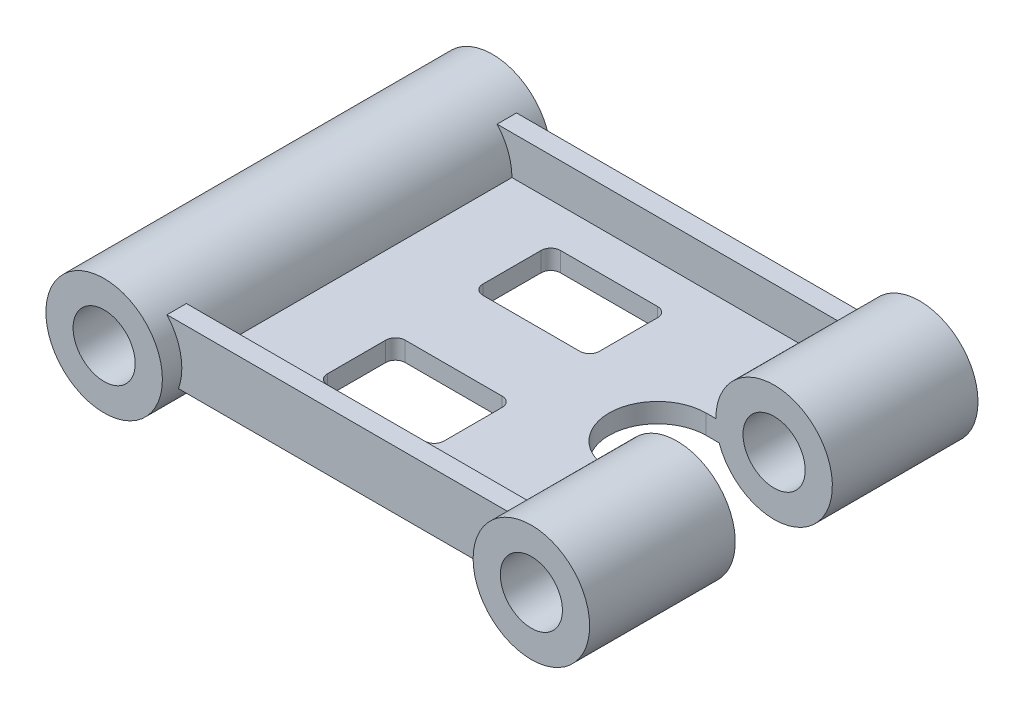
ISO-10303-21;
HEADER;
FILE_DESCRIPTION(('STEP AP214'),'2;1');
FILE_NAME('part.step','',(''),(''),'','','');
FILE_SCHEMA(('AUTOMOTIVE_DESIGN { 1 0 10303 214 1 1 1 1 }'));
ENDSEC;
DATA;
#1=APPLICATION_CONTEXT('core data for automotive mechanical design processes');
#2=APPLICATION_PROTOCOL_DEFINITION('international standard','automotive_design',2000,#1);
#3=PRODUCT_CONTEXT('',#1,'mechanical');
#4=PRODUCT('Part','Part','',(#3));
#5=PRODUCT_RELATED_PRODUCT_CATEGORY('part','',(#4));
#6=PRODUCT_DEFINITION_FORMATION('','',#4);
#7=PRODUCT_DEFINITION_CONTEXT('part definition',#1,'design');
#8=PRODUCT_DEFINITION('design','',#6,#7);
#9=PRODUCT_DEFINITION_SHAPE('','',#8);
#10=(LENGTH_UNIT() NAMED_UNIT(*) SI_UNIT(.MILLI.,.METRE.));
#11=(NAMED_UNIT(*) PLANE_ANGLE_UNIT() SI_UNIT($,.RADIAN.));
#12=(NAMED_UNIT(*) SI_UNIT($,.STERADIAN.) SOLID_ANGLE_UNIT());
#13=UNCERTAINTY_MEASURE_WITH_UNIT(LENGTH_MEASURE(1.E-05),#10,'distance_accuracy_value','');
#14=(GEOMETRIC_REPRESENTATION_CONTEXT(3) GLOBAL_UNCERTAINTY_ASSIGNED_CONTEXT((#13)) GLOBAL_UNIT_ASSIGNED_CONTEXT((#10,
#11,#12)) REPRESENTATION_CONTEXT('',''));
#15=CARTESIAN_POINT('',(0.,0.,0.));
#16=DIRECTION('',(0.,0.,1.));
#17=DIRECTION('',(1.,0.,0.));
#18=AXIS2_PLACEMENT_3D('',#15,#16,#17);
#19=CARTESIAN_POINT('',(220.,0.,100.));
#20=DIRECTION('',(0.,0.,-1.));
#21=DIRECTION('',(-1.,0.,0.));
#22=AXIS2_PLACEMENT_3D('',#19,#20,#21);
#23=CYLINDRICAL_SURFACE('',#22,30.);
#24=CARTESIAN_POINT('',(220.,0.,-100.));
#25=DIRECTION('',(0.,0.,1.));
#26=DIRECTION('',(1.,0.,0.));
#27=AXIS2_PLACEMENT_3D('',#24,#25,#26);
#28=CIRCLE('',#27,30.);
#29=CARTESIAN_POINT('',(250.,0.,-100.));
#30=VERTEX_POINT('',#29);
#31=EDGE_CURVE('E310',#30,#30,#28,.T.);
#32=ORIENTED_EDGE('',*,*,#31,.T.);
#33=EDGE_LOOP('',(#32));
#34=FACE_BOUND('',#33,.T.);
#35=CARTESIAN_POINT('',(220.,0.,-25.));
#36=DIRECTION('',(0.,0.,-1.));
#37=DIRECTION('',(-1.,0.,0.));
#38=AXIS2_PLACEMENT_3D('',#35,#36,#37);
#39=CIRCLE('',#38,30.);
#40=CARTESIAN_POINT('',(190.,0.,-25.));
#41=VERTEX_POINT('',#40);
#42=CARTESIAN_POINT('',(191.715728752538,-10.,-25.));
#43=VERTEX_POINT('',#42);
#44=EDGE_CURVE('E230',#41,#43,#39,.T.);
#45=ORIENTED_EDGE('',*,*,#44,.T.);
#46=DIRECTION('',(0.,0.,-1.));
#47=VECTOR('',#46,1.);
#48=CARTESIAN_POINT('',(191.715728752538,-9.99999999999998,90.));
#49=LINE('',#48,#47);
#50=CARTESIAN_POINT('',(191.715728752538,-9.99999999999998,-90.));
#51=VERTEX_POINT('',#50);
#52=EDGE_CURVE('E336',#43,#51,#49,.T.);
#53=ORIENTED_EDGE('',*,*,#52,.T.);
#54=CARTESIAN_POINT('',(220.,0.,-90.));
#55=DIRECTION('',(0.,0.,-1.));
#56=DIRECTION('',(1.,0.,0.));
#57=AXIS2_PLACEMENT_3D('',#54,#55,#56);
#58=CIRCLE('',#57,30.);
#59=CARTESIAN_POINT('',(197.639320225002,20.,-90.));
#60=VERTEX_POINT('',#59);
#61=EDGE_CURVE('E321',#51,#60,#58,.T.);
#62=ORIENTED_EDGE('',*,*,#61,.T.);
#63=DIRECTION('',(0.,0.,-1.));
#64=VECTOR('',#63,1.);
#65=CARTESIAN_POINT('',(197.639320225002,20.,-80.));
#66=LINE('',#65,#64);
#67=CARTESIAN_POINT('',(197.639320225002,20.,-80.));
#68=VERTEX_POINT('',#67);
#69=EDGE_CURVE('E272',#68,#60,#66,.T.);
#70=ORIENTED_EDGE('',*,*,#69,.F.);
#71=CARTESIAN_POINT('',(220.,0.,-80.));
#72=DIRECTION('',(0.,0.,-1.));
#73=DIRECTION('',(1.,0.,0.));
#74=AXIS2_PLACEMENT_3D('',#71,#72,#73);
#75=CIRCLE('',#74,30.);
#76=CARTESIAN_POINT('',(190.,0.,-79.9999999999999));
#77=VERTEX_POINT('',#76);
#78=EDGE_CURVE('E265',#77,#68,#75,.T.);
#79=ORIENTED_EDGE('',*,*,#78,.F.);
#80=DIRECTION('',(0.,0.,-1.));
#81=VECTOR('',#80,1.);
#82=CARTESIAN_POINT('',(190.,0.,90.));
#83=LINE('',#82,#81);
#84=EDGE_CURVE('E333',#41,#77,#83,.T.);
#85=ORIENTED_EDGE('',*,*,#84,.F.);
#86=EDGE_LOOP('',(#45,#53,#62,#70,#79,#85));
#87=FACE_BOUND('',#86,.T.);
#88=ADVANCED_FACE('F39',(#34,#87),#23,.T.);
#89=CARTESIAN_POINT('',(220.,0.,-100.));
#90=DIRECTION('',(0.,0.,1.));
#91=DIRECTION('',(1.,0.,0.));
#92=AXIS2_PLACEMENT_3D('',#89,#90,#91);
#93=CYLINDRICAL_SURFACE('',#92,16.);
#94=CARTESIAN_POINT('',(220.,0.,25.));
#95=DIRECTION('',(0.,0.,1.));
#96=DIRECTION('',(1.,0.,0.));
#97=AXIS2_PLACEMENT_3D('',#94,#95,#96);
#98=CIRCLE('',#97,16.);
#99=CARTESIAN_POINT('',(236.,0.,25.));
#100=VERTEX_POINT('',#99);
#101=EDGE_CURVE('E234',#100,#100,#98,.F.);
#102=ORIENTED_EDGE('',*,*,#101,.T.);
#103=EDGE_LOOP('',(#102));
#104=FACE_BOUND('',#103,.T.);
#105=CARTESIAN_POINT('',(220.,0.,100.));
#106=DIRECTION('',(0.,0.,1.));
#107=DIRECTION('',(1.,0.,0.));
#108=AXIS2_PLACEMENT_3D('',#105,#106,#107);
#109=CIRCLE('',#108,16.);
#110=CARTESIAN_POINT('',(236.,0.,100.));
#111=VERTEX_POINT('',#110);
#112=EDGE_CURVE('E296',#111,#111,#109,.T.);
#113=ORIENTED_EDGE('',*,*,#112,.T.);
#114=EDGE_LOOP('',(#113));
#115=FACE_BOUND('',#114,.T.);
#116=ADVANCED_FACE('F529',(#104,#115),#93,.F.);
#117=CARTESIAN_POINT('',(0.,0.,100.));
#118=DIRECTION('',(0.,0.,-1.));
#119=DIRECTION('',(-1.,0.,0.));
#120=AXIS2_PLACEMENT_3D('',#117,#118,#119);
#121=CYLINDRICAL_SURFACE('',#120,30.);
#122=CARTESIAN_POINT('',(0.,0.,100.));
#123=DIRECTION('',(0.,0.,1.));
#124=DIRECTION('',(1.,0.,0.));
#125=AXIS2_PLACEMENT_3D('',#122,#123,#124);
#126=CIRCLE('',#125,30.);
#127=CARTESIAN_POINT('',(30.,0.,100.));
#128=VERTEX_POINT('',#127);
#129=EDGE_CURVE('E346',#128,#128,#126,.T.);
#130=ORIENTED_EDGE('',*,*,#129,.F.);
#131=EDGE_LOOP('',(#130));
#132=FACE_BOUND('',#131,.T.);
#133=CARTESIAN_POINT('',(0.,0.,-100.));
#134=DIRECTION('',(0.,0.,1.));
#135=DIRECTION('',(1.,0.,0.));
#136=AXIS2_PLACEMENT_3D('',#133,#134,#135);
#137=CIRCLE('',#136,30.);
#138=CARTESIAN_POINT('',(30.,0.,-100.));
#139=VERTEX_POINT('',#138);
#140=EDGE_CURVE('E343',#139,#139,#137,.T.);
#141=ORIENTED_EDGE('',*,*,#140,.T.);
#142=EDGE_LOOP('',(#141));
#143=FACE_BOUND('',#142,.T.);
#144=CARTESIAN_POINT('',(0.,0.,-80.));
#145=DIRECTION('',(0.,0.,-1.));
#146=DIRECTION('',(1.,0.,0.));
#147=AXIS2_PLACEMENT_3D('',#144,#145,#146);
#148=CIRCLE('',#147,30.);
#149=CARTESIAN_POINT('',(22.3606797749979,20.,-80.));
#150=VERTEX_POINT('',#149);
#151=CARTESIAN_POINT('',(30.,0.,-79.9999999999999));
#152=VERTEX_POINT('',#151);
#153=EDGE_CURVE('E254',#150,#152,#148,.T.);
#154=ORIENTED_EDGE('',*,*,#153,.F.);
#155=DIRECTION('',(0.,0.,-1.));
#156=VECTOR('',#155,1.);
#157=CARTESIAN_POINT('',(22.3606797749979,20.,-80.));
#158=LINE('',#157,#156);
#159=CARTESIAN_POINT('',(22.3606797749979,20.,-90.));
#160=VERTEX_POINT('',#159);
#161=EDGE_CURVE('E271',#150,#160,#158,.T.);
#162=ORIENTED_EDGE('',*,*,#161,.T.);
#163=CARTESIAN_POINT('',(0.,0.,-90.));
#164=DIRECTION('',(0.,0.,-1.));
#165=DIRECTION('',(1.,0.,0.));
#166=AXIS2_PLACEMENT_3D('',#163,#164,#165);
#167=CIRCLE('',#166,30.);
#168=CARTESIAN_POINT('',(28.2842712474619,-10.,-90.));
#169=VERTEX_POINT('',#168);
#170=EDGE_CURVE('E316',#160,#169,#167,.T.);
#171=ORIENTED_EDGE('',*,*,#170,.T.);
#172=DIRECTION('',(0.,0.,-1.));
#173=VECTOR('',#172,1.);
#174=CARTESIAN_POINT('',(28.2842712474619,-10.,90.));
#175=LINE('',#174,#173);
#176=CARTESIAN_POINT('',(28.2842712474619,-9.99999999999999,90.));
#177=VERTEX_POINT('',#176);
#178=EDGE_CURVE('E340',#177,#169,#175,.T.);
#179=ORIENTED_EDGE('',*,*,#178,.F.);
#180=CARTESIAN_POINT('',(0.,0.,90.));
#181=DIRECTION('',(0.,0.,-1.));
#182=DIRECTION('',(1.,0.,0.));
#183=AXIS2_PLACEMENT_3D('',#180,#181,#182);
#184=CIRCLE('',#183,30.);
#185=CARTESIAN_POINT('',(22.3606797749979,20.,90.));
#186=VERTEX_POINT('',#185);
#187=EDGE_CURVE('E323',#186,#177,#184,.T.);
#188=ORIENTED_EDGE('',*,*,#187,.F.);
#189=DIRECTION('',(0.,0.,1.));
#190=VECTOR('',#189,1.);
#191=CARTESIAN_POINT('',(22.3606797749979,20.,80.));
#192=LINE('',#191,#190);
#193=CARTESIAN_POINT('',(22.3606797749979,20.,80.));
#194=VERTEX_POINT('',#193);
#195=EDGE_CURVE('E293',#194,#186,#192,.T.);
#196=ORIENTED_EDGE('',*,*,#195,.F.);
#197=CARTESIAN_POINT('',(0.,0.,80.));
#198=DIRECTION('',(0.,0.,-1.));
#199=DIRECTION('',(1.,0.,0.));
#200=AXIS2_PLACEMENT_3D('',#197,#198,#199);
#201=CIRCLE('',#200,30.);
#202=CARTESIAN_POINT('',(30.,0.,80.));
#203=VERTEX_POINT('',#202);
#204=EDGE_CURVE('E280',#194,#203,#201,.T.);
#205=ORIENTED_EDGE('',*,*,#204,.T.);
#206=DIRECTION('',(0.,0.,-1.));
#207=VECTOR('',#206,1.);
#208=CARTESIAN_POINT('',(30.,0.,90.));
#209=LINE('',#208,#207);
#210=EDGE_CURVE('E330',#203,#152,#209,.T.);
#211=ORIENTED_EDGE('',*,*,#210,.T.);
#212=EDGE_LOOP('',(#154,#162,#171,#179,#188,#196,#205,#211));
#213=FACE_BOUND('',#212,.T.);
#214=ADVANCED_FACE('F41',(#132,#143,#213),#121,.T.);
#215=CARTESIAN_POINT('',(30.,0.,90.));
#216=DIRECTION('',(0.,-1.,0.));
#217=DIRECTION('',(0.,0.,-1.));
#218=AXIS2_PLACEMENT_3D('',#215,#216,#217);
#219=PLANE('',#218);
#220=DIRECTION('',(-1.,0.,0.));
#221=VECTOR('',#220,1.);
#222=CARTESIAN_POINT('',(130.,0.,20.));
#223=LINE('',#222,#221);
#224=CARTESIAN_POINT('',(125.,0.,20.));
#225=VERTEX_POINT('',#224);
#226=CARTESIAN_POINT('',(75.,0.,20.));
#227=VERTEX_POINT('',#226);
#228=EDGE_CURVE('E790',#225,#227,#223,.T.);
#229=ORIENTED_EDGE('',*,*,#228,.F.);
#230=CARTESIAN_POINT('',(125.,0.,25.));
#231=DIRECTION('',(0.,-1.,0.));
#232=DIRECTION('',(0.,0.,-1.));
#233=AXIS2_PLACEMENT_3D('',#230,#231,#232);
#234=CIRCLE('',#233,5.);
#235=CARTESIAN_POINT('',(130.,0.,25.));
#236=VERTEX_POINT('',#235);
#237=EDGE_CURVE('E418',#225,#236,#234,.T.);
#238=ORIENTED_EDGE('',*,*,#237,.T.);
#239=DIRECTION('',(0.,0.,-1.));
#240=VECTOR('',#239,1.);
#241=CARTESIAN_POINT('',(130.,0.,20.));
#242=LINE('',#241,#240);
#243=CARTESIAN_POINT('',(130.,0.,55.));
#244=VERTEX_POINT('',#243);
#245=EDGE_CURVE('E786',#244,#236,#242,.T.);
#246=ORIENTED_EDGE('',*,*,#245,.F.);
#247=CARTESIAN_POINT('',(125.,0.,55.));
#248=DIRECTION('',(0.,-1.,0.));
#249=DIRECTION('',(0.,0.,-1.));
#250=AXIS2_PLACEMENT_3D('',#247,#248,#249);
#251=CIRCLE('',#250,5.);
#252=CARTESIAN_POINT('',(125.,0.,60.));
#253=VERTEX_POINT('',#252);
#254=EDGE_CURVE('E422',#244,#253,#251,.T.);
#255=ORIENTED_EDGE('',*,*,#254,.T.);
#256=DIRECTION('',(1.,0.,0.));
#257=VECTOR('',#256,1.);
#258=CARTESIAN_POINT('',(130.,0.,60.));
#259=LINE('',#258,#257);
#260=CARTESIAN_POINT('',(75.,0.,60.));
#261=VERTEX_POINT('',#260);
#262=EDGE_CURVE('E454',#261,#253,#259,.T.);
#263=ORIENTED_EDGE('',*,*,#262,.F.);
#264=CARTESIAN_POINT('',(75.,0.,55.));
#265=DIRECTION('',(0.,-1.,0.));
#266=DIRECTION('',(0.,0.,-1.));
#267=AXIS2_PLACEMENT_3D('',#264,#265,#266);
#268=CIRCLE('',#267,5.);
#269=CARTESIAN_POINT('',(70.,0.,55.));
#270=VERTEX_POINT('',#269);
#271=EDGE_CURVE('E426',#261,#270,#268,.T.);
#272=ORIENTED_EDGE('',*,*,#271,.T.);
#273=DIRECTION('',(0.,0.,1.));
#274=VECTOR('',#273,1.);
#275=CARTESIAN_POINT('',(70.,0.,20.));
#276=LINE('',#275,#274);
#277=CARTESIAN_POINT('',(70.,0.,25.));
#278=VERTEX_POINT('',#277);
#279=EDGE_CURVE('E773',#278,#270,#276,.T.);
#280=ORIENTED_EDGE('',*,*,#279,.F.);
#281=CARTESIAN_POINT('',(75.,0.,25.));
#282=DIRECTION('',(0.,-1.,0.));
#283=DIRECTION('',(0.,0.,-1.));
#284=AXIS2_PLACEMENT_3D('',#281,#282,#283);
#285=CIRCLE('',#284,5.);
#286=EDGE_CURVE('E430',#278,#227,#285,.T.);
#287=ORIENTED_EDGE('',*,*,#286,.T.);
#288=EDGE_LOOP('',(#229,#238,#246,#255,#263,#272,#280,#287));
#289=FACE_BOUND('',#288,.T.);
#290=DIRECTION('',(-1.,0.,0.));
#291=VECTOR('',#290,1.);
#292=CARTESIAN_POINT('',(130.,0.,-60.));
#293=LINE('',#292,#291);
#294=CARTESIAN_POINT('',(125.,0.,-60.));
#295=VERTEX_POINT('',#294);
#296=CARTESIAN_POINT('',(75.,0.,-60.));
#297=VERTEX_POINT('',#296);
#298=EDGE_CURVE('E449',#295,#297,#293,.T.);
#299=ORIENTED_EDGE('',*,*,#298,.F.);
#300=CARTESIAN_POINT('',(125.,0.,-55.));
#301=DIRECTION('',(0.,-1.,0.));
#302=DIRECTION('',(0.,0.,-1.));
#303=AXIS2_PLACEMENT_3D('',#300,#301,#302);
#304=CIRCLE('',#303,5.);
#305=CARTESIAN_POINT('',(130.,0.,-55.));
#306=VERTEX_POINT('',#305);
#307=EDGE_CURVE('E47',#295,#306,#304,.T.);
#308=ORIENTED_EDGE('',*,*,#307,.T.);
#309=DIRECTION('',(0.,0.,-1.));
#310=VECTOR('',#309,1.);
#311=CARTESIAN_POINT('',(130.,0.,-60.));
#312=LINE('',#311,#310);
#313=CARTESIAN_POINT('',(130.,0.,-25.));
#314=VERTEX_POINT('',#313);
#315=EDGE_CURVE('E447',#314,#306,#312,.T.);
#316=ORIENTED_EDGE('',*,*,#315,.F.);
#317=CARTESIAN_POINT('',(125.,0.,-25.));
#318=DIRECTION('',(0.,-1.,0.));
#319=DIRECTION('',(0.,0.,-1.));
#320=AXIS2_PLACEMENT_3D('',#317,#318,#319);
#321=CIRCLE('',#320,5.);
#322=CARTESIAN_POINT('',(125.,0.,-20.));
#323=VERTEX_POINT('',#322);
#324=EDGE_CURVE('E442',#314,#323,#321,.T.);
#325=ORIENTED_EDGE('',*,*,#324,.T.);
#326=DIRECTION('',(1.,0.,0.));
#327=VECTOR('',#326,1.);
#328=CARTESIAN_POINT('',(130.,0.,-20.));
#329=LINE('',#328,#327);
#330=CARTESIAN_POINT('',(75.,0.,-20.));
#331=VERTEX_POINT('',#330);
#332=EDGE_CURVE('E245',#331,#323,#329,.T.);
#333=ORIENTED_EDGE('',*,*,#332,.F.);
#334=CARTESIAN_POINT('',(75.,0.,-25.));
#335=DIRECTION('',(0.,-1.,0.));
#336=DIRECTION('',(0.,0.,-1.));
#337=AXIS2_PLACEMENT_3D('',#334,#335,#336);
#338=CIRCLE('',#337,5.);
#339=CARTESIAN_POINT('',(70.,0.,-25.));
#340=VERTEX_POINT('',#339);
#341=EDGE_CURVE('E438',#331,#340,#338,.T.);
#342=ORIENTED_EDGE('',*,*,#341,.T.);
#343=DIRECTION('',(0.,0.,1.));
#344=VECTOR('',#343,1.);
#345=CARTESIAN_POINT('',(70.,0.,-60.));
#346=LINE('',#345,#344);
#347=CARTESIAN_POINT('',(70.,0.,-55.));
#348=VERTEX_POINT('',#347);
#349=EDGE_CURVE('E475',#348,#340,#346,.T.);
#350=ORIENTED_EDGE('',*,*,#349,.F.);
#351=CARTESIAN_POINT('',(75.,0.,-55.));
#352=DIRECTION('',(0.,-1.,0.));
#353=DIRECTION('',(0.,0.,-1.));
#354=AXIS2_PLACEMENT_3D('',#351,#352,#353);
#355=CIRCLE('',#354,5.);
#356=EDGE_CURVE('E434',#348,#297,#355,.T.);
#357=ORIENTED_EDGE('',*,*,#356,.T.);
#358=EDGE_LOOP('',(#299,#308,#316,#325,#333,#342,#350,#357));
#359=FACE_BOUND('',#358,.T.);
#360=CARTESIAN_POINT('',(190.,0.,80.));
#361=VERTEX_POINT('',#360);
#362=CARTESIAN_POINT('',(190.,0.,25.));
#363=VERTEX_POINT('',#362);
#364=EDGE_CURVE('E334',#361,#363,#83,.T.);
#365=ORIENTED_EDGE('',*,*,#364,.T.);
#366=DIRECTION('',(-1.,0.,0.));
#367=VECTOR('',#366,1.);
#368=CARTESIAN_POINT('',(30.,0.,25.));
#369=LINE('',#368,#367);
#370=CARTESIAN_POINT('',(185.,0.,25.));
#371=VERTEX_POINT('',#370);
#372=EDGE_CURVE('E250',#363,#371,#369,.T.);
#373=ORIENTED_EDGE('',*,*,#372,.T.);
#374=CARTESIAN_POINT('',(185.,0.,0.));
#375=DIRECTION('',(0.,-1.,0.));
#376=DIRECTION('',(0.,0.,-1.));
#377=AXIS2_PLACEMENT_3D('',#374,#375,#376);
#378=CIRCLE('',#377,25.);
#379=CARTESIAN_POINT('',(185.,0.,-25.));
#380=VERTEX_POINT('',#379);
#381=EDGE_CURVE('E239',#371,#380,#378,.T.);
#382=ORIENTED_EDGE('',*,*,#381,.T.);
#383=DIRECTION('',(1.,0.,0.));
#384=VECTOR('',#383,1.);
#385=CARTESIAN_POINT('',(30.,0.,-25.));
#386=LINE('',#385,#384);
#387=EDGE_CURVE('E224',#380,#41,#386,.T.);
#388=ORIENTED_EDGE('',*,*,#387,.T.);
#389=ORIENTED_EDGE('',*,*,#84,.T.);
#390=DIRECTION('',(1.,0.,0.));
#391=VECTOR('',#390,1.);
#392=CARTESIAN_POINT('',(190.,0.,-80.));
#393=LINE('',#392,#391);
#394=EDGE_CURVE('E268',#152,#77,#393,.T.);
#395=ORIENTED_EDGE('',*,*,#394,.F.);
#396=ORIENTED_EDGE('',*,*,#210,.F.);
#397=DIRECTION('',(1.,0.,0.));
#398=VECTOR('',#397,1.);
#399=CARTESIAN_POINT('',(190.,0.,80.));
#400=LINE('',#399,#398);
#401=EDGE_CURVE('E283',#203,#361,#400,.T.);
#402=ORIENTED_EDGE('',*,*,#401,.T.);
#403=EDGE_LOOP('',(#365,#373,#382,#388,#389,#395,#396,#402));
#404=FACE_BOUND('',#403,.T.);
#405=ADVANCED_FACE('F249',(#289,#359,#404),#219,.F.);
#406=CARTESIAN_POINT('',(220.,0.,100.));
#407=DIRECTION('',(0.,0.,1.));
#408=DIRECTION('',(1.,0.,0.));
#409=AXIS2_PLACEMENT_3D('',#406,#407,#408);
#410=CIRCLE('',#409,30.);
#411=CARTESIAN_POINT('',(250.,0.,100.));
#412=VERTEX_POINT('',#411);
#413=EDGE_CURVE('E313',#412,#412,#410,.T.);
#414=ORIENTED_EDGE('',*,*,#413,.F.);
#415=EDGE_LOOP('',(#414));
#416=FACE_BOUND('',#415,.T.);
#417=CARTESIAN_POINT('',(191.715728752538,-9.99999999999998,90.));
#418=VERTEX_POINT('',#417);
#419=CARTESIAN_POINT('',(191.715728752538,-10.,25.));
#420=VERTEX_POINT('',#419);
#421=EDGE_CURVE('E337',#418,#420,#49,.T.);
#422=ORIENTED_EDGE('',*,*,#421,.T.);
#423=CARTESIAN_POINT('',(220.,0.,25.));
#424=DIRECTION('',(0.,0.,1.));
#425=DIRECTION('',(1.,0.,0.));
#426=AXIS2_PLACEMENT_3D('',#423,#424,#425);
#427=CIRCLE('',#426,30.);
#428=EDGE_CURVE('E256',#420,#363,#427,.T.);
#429=ORIENTED_EDGE('',*,*,#428,.T.);
#430=ORIENTED_EDGE('',*,*,#364,.F.);
#431=CARTESIAN_POINT('',(220.,0.,80.));
#432=DIRECTION('',(0.,0.,-1.));
#433=DIRECTION('',(1.,0.,0.));
#434=AXIS2_PLACEMENT_3D('',#431,#432,#433);
#435=CIRCLE('',#434,30.);
#436=CARTESIAN_POINT('',(197.639320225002,20.,80.));
#437=VERTEX_POINT('',#436);
#438=EDGE_CURVE('E286',#361,#437,#435,.T.);
#439=ORIENTED_EDGE('',*,*,#438,.T.);
#440=DIRECTION('',(0.,0.,1.));
#441=VECTOR('',#440,1.);
#442=CARTESIAN_POINT('',(197.639320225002,20.,80.));
#443=LINE('',#442,#441);
#444=CARTESIAN_POINT('',(197.639320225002,20.,90.));
#445=VERTEX_POINT('',#444);
#446=EDGE_CURVE('E292',#437,#445,#443,.T.);
#447=ORIENTED_EDGE('',*,*,#446,.T.);
#448=CARTESIAN_POINT('',(220.,0.,90.));
#449=DIRECTION('',(0.,0.,-1.));
#450=DIRECTION('',(1.,0.,0.));
#451=AXIS2_PLACEMENT_3D('',#448,#449,#450);
#452=CIRCLE('',#451,30.);
#453=EDGE_CURVE('E328',#418,#445,#452,.T.);
#454=ORIENTED_EDGE('',*,*,#453,.F.);
#455=EDGE_LOOP('',(#422,#429,#430,#439,#447,#454));
#456=FACE_BOUND('',#455,.T.);
#457=ADVANCED_FACE('F498',(#416,#456),#23,.T.);
#458=CARTESIAN_POINT('',(0.,0.,100.));
#459=DIRECTION('',(0.,0.,1.));
#460=DIRECTION('',(1.,0.,0.));
#461=AXIS2_PLACEMENT_3D('',#458,#459,#460);
#462=PLANE('',#461);
#463=CARTESIAN_POINT('',(0.,0.,100.));
#464=DIRECTION('',(0.,0.,1.));
#465=DIRECTION('',(1.,0.,0.));
#466=AXIS2_PLACEMENT_3D('',#463,#464,#465);
#467=CIRCLE('',#466,16.);
#468=CARTESIAN_POINT('',(16.,0.,100.));
#469=VERTEX_POINT('',#468);
#470=EDGE_CURVE('E304',#469,#469,#467,.T.);
#471=ORIENTED_EDGE('',*,*,#470,.F.);
#472=EDGE_LOOP('',(#471));
#473=FACE_BOUND('',#472,.T.);
#474=ORIENTED_EDGE('',*,*,#129,.T.);
#475=EDGE_LOOP('',(#474));
#476=FACE_BOUND('',#475,.T.);
#477=ADVANCED_FACE('F543',(#473,#476),#462,.T.);
#478=CARTESIAN_POINT('',(0.,0.,-100.));
#479=DIRECTION('',(0.,0.,1.));
#480=DIRECTION('',(1.,0.,0.));
#481=AXIS2_PLACEMENT_3D('',#478,#479,#480);
#482=PLANE('',#481);
#483=CARTESIAN_POINT('',(0.,0.,-100.));
#484=DIRECTION('',(0.,0.,1.));
#485=DIRECTION('',(1.,0.,0.));
#486=AXIS2_PLACEMENT_3D('',#483,#484,#485);
#487=CIRCLE('',#486,16.);
#488=CARTESIAN_POINT('',(16.,0.,-100.));
#489=VERTEX_POINT('',#488);
#490=EDGE_CURVE('E307',#489,#489,#487,.T.);
#491=ORIENTED_EDGE('',*,*,#490,.T.);
#492=EDGE_LOOP('',(#491));
#493=FACE_BOUND('',#492,.T.);
#494=ORIENTED_EDGE('',*,*,#140,.F.);
#495=EDGE_LOOP('',(#494));
#496=FACE_BOUND('',#495,.T.);
#497=ADVANCED_FACE('F549',(#493,#496),#482,.F.);
#498=CARTESIAN_POINT('',(28.2842712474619,-10.,90.));
#499=DIRECTION('',(0.,1.,0.));
#500=DIRECTION('',(0.,0.,1.));
#501=AXIS2_PLACEMENT_3D('',#498,#499,#500);
#502=PLANE('',#501);
#503=DIRECTION('',(0.,0.,1.));
#504=VECTOR('',#503,1.);
#505=CARTESIAN_POINT('',(70.,-10.,90.));
#506=LINE('',#505,#504);
#507=CARTESIAN_POINT('',(70.,-10.,25.));
#508=VERTEX_POINT('',#507);
#509=CARTESIAN_POINT('',(70.,-10.,55.));
#510=VERTEX_POINT('',#509);
#511=EDGE_CURVE('E370',#508,#510,#506,.T.);
#512=ORIENTED_EDGE('',*,*,#511,.T.);
#513=CARTESIAN_POINT('',(75.,-10.,55.));
#514=DIRECTION('',(0.,1.,0.));
#515=DIRECTION('',(0.,0.,1.));
#516=AXIS2_PLACEMENT_3D('',#513,#514,#515);
#517=CIRCLE('',#516,5.);
#518=CARTESIAN_POINT('',(75.,-10.,60.));
#519=VERTEX_POINT('',#518);
#520=EDGE_CURVE('E428',#510,#519,#517,.T.);
#521=ORIENTED_EDGE('',*,*,#520,.T.);
#522=DIRECTION('',(1.,0.,0.));
#523=VECTOR('',#522,1.);
#524=CARTESIAN_POINT('',(28.2842712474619,-10.,60.));
#525=LINE('',#524,#523);
#526=CARTESIAN_POINT('',(125.,-10.,60.));
#527=VERTEX_POINT('',#526);
#528=EDGE_CURVE('E373',#519,#527,#525,.T.);
#529=ORIENTED_EDGE('',*,*,#528,.T.);
#530=CARTESIAN_POINT('',(125.,-10.,55.));
#531=DIRECTION('',(0.,1.,0.));
#532=DIRECTION('',(0.,0.,1.));
#533=AXIS2_PLACEMENT_3D('',#530,#531,#532);
#534=CIRCLE('',#533,5.);
#535=CARTESIAN_POINT('',(130.,-10.,55.));
#536=VERTEX_POINT('',#535);
#537=EDGE_CURVE('E424',#527,#536,#534,.T.);
#538=ORIENTED_EDGE('',*,*,#537,.T.);
#539=DIRECTION('',(0.,0.,-1.));
#540=VECTOR('',#539,1.);
#541=CARTESIAN_POINT('',(130.,-10.,90.));
#542=LINE('',#541,#540);
#543=CARTESIAN_POINT('',(130.,-10.,25.));
#544=VERTEX_POINT('',#543);
#545=EDGE_CURVE('E376',#536,#544,#542,.T.);
#546=ORIENTED_EDGE('',*,*,#545,.T.);
#547=CARTESIAN_POINT('',(125.,-10.,25.));
#548=DIRECTION('',(0.,1.,0.));
#549=DIRECTION('',(0.,0.,1.));
#550=AXIS2_PLACEMENT_3D('',#547,#548,#549);
#551=CIRCLE('',#550,5.);
#552=CARTESIAN_POINT('',(125.,-10.,20.));
#553=VERTEX_POINT('',#552);
#554=EDGE_CURVE('E420',#544,#553,#551,.T.);
#555=ORIENTED_EDGE('',*,*,#554,.T.);
#556=DIRECTION('',(-1.,0.,0.));
#557=VECTOR('',#556,1.);
#558=CARTESIAN_POINT('',(28.2842712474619,-10.,20.));
#559=LINE('',#558,#557);
#560=CARTESIAN_POINT('',(75.,-10.,20.));
#561=VERTEX_POINT('',#560);
#562=EDGE_CURVE('E367',#553,#561,#559,.T.);
#563=ORIENTED_EDGE('',*,*,#562,.T.);
#564=CARTESIAN_POINT('',(75.,-10.,25.));
#565=DIRECTION('',(0.,1.,0.));
#566=DIRECTION('',(0.,0.,1.));
#567=AXIS2_PLACEMENT_3D('',#564,#565,#566);
#568=CIRCLE('',#567,5.);
#569=EDGE_CURVE('E432',#561,#508,#568,.T.);
#570=ORIENTED_EDGE('',*,*,#569,.T.);
#571=EDGE_LOOP('',(#512,#521,#529,#538,#546,#555,#563,#570));
#572=FACE_BOUND('',#571,.T.);
#573=DIRECTION('',(0.,0.,1.));
#574=VECTOR('',#573,1.);
#575=CARTESIAN_POINT('',(70.,-10.,90.));
#576=LINE('',#575,#574);
#577=CARTESIAN_POINT('',(70.,-10.,-55.));
#578=VERTEX_POINT('',#577);
#579=CARTESIAN_POINT('',(70.,-10.,-25.));
#580=VERTEX_POINT('',#579);
#581=EDGE_CURVE('E360',#578,#580,#576,.T.);
#582=ORIENTED_EDGE('',*,*,#581,.T.);
#583=CARTESIAN_POINT('',(75.,-10.,-25.));
#584=DIRECTION('',(0.,1.,0.));
#585=DIRECTION('',(0.,0.,1.));
#586=AXIS2_PLACEMENT_3D('',#583,#584,#585);
#587=CIRCLE('',#586,5.);
#588=CARTESIAN_POINT('',(75.,-10.,-20.));
#589=VERTEX_POINT('',#588);
#590=EDGE_CURVE('E440',#580,#589,#587,.T.);
#591=ORIENTED_EDGE('',*,*,#590,.T.);
#592=DIRECTION('',(1.,0.,0.));
#593=VECTOR('',#592,1.);
#594=CARTESIAN_POINT('',(28.2842712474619,-10.,-20.));
#595=LINE('',#594,#593);
#596=CARTESIAN_POINT('',(125.,-10.,-20.));
#597=VERTEX_POINT('',#596);
#598=EDGE_CURVE('E363',#589,#597,#595,.T.);
#599=ORIENTED_EDGE('',*,*,#598,.T.);
#600=CARTESIAN_POINT('',(125.,-10.,-25.));
#601=DIRECTION('',(0.,1.,0.));
#602=DIRECTION('',(0.,0.,1.));
#603=AXIS2_PLACEMENT_3D('',#600,#601,#602);
#604=CIRCLE('',#603,5.);
#605=CARTESIAN_POINT('',(130.,-10.,-25.));
#606=VERTEX_POINT('',#605);
#607=EDGE_CURVE('E61',#597,#606,#604,.T.);
#608=ORIENTED_EDGE('',*,*,#607,.T.);
#609=DIRECTION('',(0.,0.,-1.));
#610=VECTOR('',#609,1.);
#611=CARTESIAN_POINT('',(130.,-10.,90.));
#612=LINE('',#611,#610);
#613=CARTESIAN_POINT('',(130.,-10.,-55.));
#614=VERTEX_POINT('',#613);
#615=EDGE_CURVE('E365',#606,#614,#612,.T.);
#616=ORIENTED_EDGE('',*,*,#615,.T.);
#617=CARTESIAN_POINT('',(125.,-10.,-55.));
#618=DIRECTION('',(0.,1.,0.));
#619=DIRECTION('',(0.,0.,1.));
#620=AXIS2_PLACEMENT_3D('',#617,#618,#619);
#621=CIRCLE('',#620,5.);
#622=CARTESIAN_POINT('',(125.,-10.,-60.));
#623=VERTEX_POINT('',#622);
#624=EDGE_CURVE('E11',#614,#623,#621,.T.);
#625=ORIENTED_EDGE('',*,*,#624,.T.);
#626=DIRECTION('',(-1.,0.,0.));
#627=VECTOR('',#626,1.);
#628=CARTESIAN_POINT('',(28.2842712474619,-10.,-60.));
#629=LINE('',#628,#627);
#630=CARTESIAN_POINT('',(75.,-10.,-60.));
#631=VERTEX_POINT('',#630);
#632=EDGE_CURVE('E357',#623,#631,#629,.T.);
#633=ORIENTED_EDGE('',*,*,#632,.T.);
#634=CARTESIAN_POINT('',(75.,-10.,-55.));
#635=DIRECTION('',(0.,1.,0.));
#636=DIRECTION('',(0.,0.,1.));
#637=AXIS2_PLACEMENT_3D('',#634,#635,#636);
#638=CIRCLE('',#637,5.);
#639=EDGE_CURVE('E436',#631,#578,#638,.T.);
#640=ORIENTED_EDGE('',*,*,#639,.T.);
#641=EDGE_LOOP('',(#582,#591,#599,#608,#616,#625,#633,#640));
#642=FACE_BOUND('',#641,.T.);
#643=CARTESIAN_POINT('',(185.,-10.,0.));
#644=DIRECTION('',(0.,1.,0.));
#645=DIRECTION('',(0.,0.,1.));
#646=AXIS2_PLACEMENT_3D('',#643,#644,#645);
#647=CIRCLE('',#646,25.);
#648=CARTESIAN_POINT('',(185.,-10.,-25.));
#649=VERTEX_POINT('',#648);
#650=CARTESIAN_POINT('',(185.,-10.,25.));
#651=VERTEX_POINT('',#650);
#652=EDGE_CURVE('E242',#649,#651,#647,.T.);
#653=ORIENTED_EDGE('',*,*,#652,.T.);
#654=DIRECTION('',(1.,0.,0.));
#655=VECTOR('',#654,1.);
#656=CARTESIAN_POINT('',(28.2842712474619,-10.,25.));
#657=LINE('',#656,#655);
#658=EDGE_CURVE('E355',#651,#420,#657,.T.);
#659=ORIENTED_EDGE('',*,*,#658,.T.);
#660=ORIENTED_EDGE('',*,*,#421,.F.);
#661=DIRECTION('',(1.,0.,0.));
#662=VECTOR('',#661,1.);
#663=CARTESIAN_POINT('',(28.2842712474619,-10.,90.));
#664=LINE('',#663,#662);
#665=EDGE_CURVE('E326',#177,#418,#664,.T.);
#666=ORIENTED_EDGE('',*,*,#665,.F.);
#667=ORIENTED_EDGE('',*,*,#178,.T.);
#668=DIRECTION('',(1.,0.,0.));
#669=VECTOR('',#668,1.);
#670=CARTESIAN_POINT('',(28.2842712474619,-10.,-90.));
#671=LINE('',#670,#669);
#672=EDGE_CURVE('E318',#169,#51,#671,.T.);
#673=ORIENTED_EDGE('',*,*,#672,.T.);
#674=ORIENTED_EDGE('',*,*,#52,.F.);
#675=DIRECTION('',(-1.,0.,0.));
#676=VECTOR('',#675,1.);
#677=CARTESIAN_POINT('',(28.2842712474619,-10.,-25.));
#678=LINE('',#677,#676);
#679=EDGE_CURVE('E352',#43,#649,#678,.T.);
#680=ORIENTED_EDGE('',*,*,#679,.T.);
#681=EDGE_LOOP('',(#653,#659,#660,#666,#667,#673,#674,#680));
#682=FACE_BOUND('',#681,.T.);
#683=ADVANCED_FACE('F459',(#572,#642,#682),#502,.F.);
#684=CARTESIAN_POINT('',(0.,0.,90.));
#685=DIRECTION('',(0.,0.,1.));
#686=DIRECTION('',(1.,0.,0.));
#687=AXIS2_PLACEMENT_3D('',#684,#685,#686);
#688=PLANE('',#687);
#689=ORIENTED_EDGE('',*,*,#187,.T.);
#690=ORIENTED_EDGE('',*,*,#665,.T.);
#691=ORIENTED_EDGE('',*,*,#453,.T.);
#692=DIRECTION('',(-1.,0.,0.));
#693=VECTOR('',#692,1.);
#694=CARTESIAN_POINT('',(22.3606797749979,20.,90.));
#695=LINE('',#694,#693);
#696=EDGE_CURVE('E275',#445,#186,#695,.T.);
#697=ORIENTED_EDGE('',*,*,#696,.T.);
#698=EDGE_LOOP('',(#689,#690,#691,#697));
#699=FACE_BOUND('',#698,.T.);
#700=ADVANCED_FACE('F512',(#699),#688,.T.);
#701=CARTESIAN_POINT('',(0.,0.,-90.));
#702=DIRECTION('',(0.,0.,1.));
#703=DIRECTION('',(1.,0.,0.));
#704=AXIS2_PLACEMENT_3D('',#701,#702,#703);
#705=PLANE('',#704);
#706=ORIENTED_EDGE('',*,*,#170,.F.);
#707=DIRECTION('',(-1.,0.,0.));
#708=VECTOR('',#707,1.);
#709=CARTESIAN_POINT('',(22.3606797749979,20.,-90.));
#710=LINE('',#709,#708);
#711=EDGE_CURVE('E251',#60,#160,#710,.T.);
#712=ORIENTED_EDGE('',*,*,#711,.F.);
#713=ORIENTED_EDGE('',*,*,#61,.F.);
#714=ORIENTED_EDGE('',*,*,#672,.F.);
#715=EDGE_LOOP('',(#706,#712,#713,#714));
#716=FACE_BOUND('',#715,.T.);
#717=ADVANCED_FACE('F559',(#716),#705,.F.);
#718=CARTESIAN_POINT('',(220.,0.,100.));
#719=DIRECTION('',(0.,0.,1.));
#720=DIRECTION('',(1.,0.,0.));
#721=AXIS2_PLACEMENT_3D('',#718,#719,#720);
#722=PLANE('',#721);
#723=ORIENTED_EDGE('',*,*,#112,.F.);
#724=EDGE_LOOP('',(#723));
#725=FACE_BOUND('',#724,.T.);
#726=ORIENTED_EDGE('',*,*,#413,.T.);
#727=EDGE_LOOP('',(#726));
#728=FACE_BOUND('',#727,.T.);
#729=ADVANCED_FACE('F556',(#725,#728),#722,.T.);
#730=CARTESIAN_POINT('',(220.,0.,-100.));
#731=DIRECTION('',(0.,0.,1.));
#732=DIRECTION('',(1.,0.,0.));
#733=AXIS2_PLACEMENT_3D('',#730,#731,#732);
#734=PLANE('',#733);
#735=CARTESIAN_POINT('',(220.,0.,-100.));
#736=DIRECTION('',(0.,0.,1.));
#737=DIRECTION('',(1.,0.,0.));
#738=AXIS2_PLACEMENT_3D('',#735,#736,#737);
#739=CIRCLE('',#738,16.);
#740=CARTESIAN_POINT('',(236.,0.,-100.));
#741=VERTEX_POINT('',#740);
#742=EDGE_CURVE('E301',#741,#741,#739,.T.);
#743=ORIENTED_EDGE('',*,*,#742,.T.);
#744=EDGE_LOOP('',(#743));
#745=FACE_BOUND('',#744,.T.);
#746=ORIENTED_EDGE('',*,*,#31,.F.);
#747=EDGE_LOOP('',(#746));
#748=FACE_BOUND('',#747,.T.);
#749=ADVANCED_FACE('F558',(#745,#748),#734,.F.);
#750=CARTESIAN_POINT('',(0.,0.,-100.));
#751=DIRECTION('',(0.,0.,1.));
#752=DIRECTION('',(1.,0.,0.));
#753=AXIS2_PLACEMENT_3D('',#750,#751,#752);
#754=CYLINDRICAL_SURFACE('',#753,16.);
#755=ORIENTED_EDGE('',*,*,#490,.F.);
#756=EDGE_LOOP('',(#755));
#757=FACE_BOUND('',#756,.T.);
#758=ORIENTED_EDGE('',*,*,#470,.T.);
#759=EDGE_LOOP('',(#758));
#760=FACE_BOUND('',#759,.T.);
#761=ADVANCED_FACE('F565',(#757,#760),#754,.F.);
#762=CARTESIAN_POINT('',(220.,0.,-25.));
#763=DIRECTION('',(0.,0.,-1.));
#764=DIRECTION('',(-1.,0.,0.));
#765=AXIS2_PLACEMENT_3D('',#762,#763,#764);
#766=CIRCLE('',#765,16.);
#767=CARTESIAN_POINT('',(204.,0.,-25.));
#768=VERTEX_POINT('',#767);
#769=EDGE_CURVE('E349',#768,#768,#766,.F.);
#770=ORIENTED_EDGE('',*,*,#769,.T.);
#771=EDGE_LOOP('',(#770));
#772=FACE_BOUND('',#771,.T.);
#773=ORIENTED_EDGE('',*,*,#742,.F.);
#774=EDGE_LOOP('',(#773));
#775=FACE_BOUND('',#774,.T.);
#776=ADVANCED_FACE('F538',(#772,#775),#93,.F.);
#777=CARTESIAN_POINT('',(22.3606797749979,20.,80.));
#778=DIRECTION('',(0.,1.,0.));
#779=DIRECTION('',(0.,0.,1.));
#780=AXIS2_PLACEMENT_3D('',#777,#778,#779);
#781=PLANE('',#780);
#782=ORIENTED_EDGE('',*,*,#696,.F.);
#783=ORIENTED_EDGE('',*,*,#446,.F.);
#784=DIRECTION('',(-1.,0.,0.));
#785=VECTOR('',#784,1.);
#786=CARTESIAN_POINT('',(22.3606797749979,20.,80.));
#787=LINE('',#786,#785);
#788=EDGE_CURVE('E289',#437,#194,#787,.T.);
#789=ORIENTED_EDGE('',*,*,#788,.T.);
#790=ORIENTED_EDGE('',*,*,#195,.T.);
#791=EDGE_LOOP('',(#782,#783,#789,#790));
#792=FACE_BOUND('',#791,.T.);
#793=ADVANCED_FACE('F510',(#792),#781,.T.);
#794=CARTESIAN_POINT('',(0.,0.,80.));
#795=DIRECTION('',(0.,0.,1.));
#796=DIRECTION('',(1.,0.,0.));
#797=AXIS2_PLACEMENT_3D('',#794,#795,#796);
#798=PLANE('',#797);
#799=ORIENTED_EDGE('',*,*,#204,.F.);
#800=ORIENTED_EDGE('',*,*,#788,.F.);
#801=ORIENTED_EDGE('',*,*,#438,.F.);
#802=ORIENTED_EDGE('',*,*,#401,.F.);
#803=EDGE_LOOP('',(#799,#800,#801,#802));
#804=FACE_BOUND('',#803,.T.);
#805=ADVANCED_FACE('F504',(#804),#798,.F.);
#806=CARTESIAN_POINT('',(22.3606797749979,20.,-80.));
#807=DIRECTION('',(0.,-1.,0.));
#808=DIRECTION('',(0.,0.,-1.));
#809=AXIS2_PLACEMENT_3D('',#806,#807,#808);
#810=PLANE('',#809);
#811=ORIENTED_EDGE('',*,*,#711,.T.);
#812=ORIENTED_EDGE('',*,*,#161,.F.);
#813=DIRECTION('',(-1.,0.,0.));
#814=VECTOR('',#813,1.);
#815=CARTESIAN_POINT('',(22.3606797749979,20.,-80.));
#816=LINE('',#815,#814);
#817=EDGE_CURVE('E262',#68,#150,#816,.T.);
#818=ORIENTED_EDGE('',*,*,#817,.F.);
#819=ORIENTED_EDGE('',*,*,#69,.T.);
#820=EDGE_LOOP('',(#811,#812,#818,#819));
#821=FACE_BOUND('',#820,.T.);
#822=ADVANCED_FACE('F580',(#821),#810,.F.);
#823=CARTESIAN_POINT('',(0.,0.,-80.));
#824=DIRECTION('',(0.,0.,-1.));
#825=DIRECTION('',(1.,0.,0.));
#826=AXIS2_PLACEMENT_3D('',#823,#824,#825);
#827=PLANE('',#826);
#828=ORIENTED_EDGE('',*,*,#153,.T.);
#829=ORIENTED_EDGE('',*,*,#394,.T.);
#830=ORIENTED_EDGE('',*,*,#78,.T.);
#831=ORIENTED_EDGE('',*,*,#817,.T.);
#832=EDGE_LOOP('',(#828,#829,#830,#831));
#833=FACE_BOUND('',#832,.T.);
#834=ADVANCED_FACE('F524',(#833),#827,.F.);
#835=CARTESIAN_POINT('',(185.,-30.,0.));
#836=DIRECTION('',(0.,1.,0.));
#837=DIRECTION('',(0.,0.,1.));
#838=AXIS2_PLACEMENT_3D('',#835,#836,#837);
#839=CYLINDRICAL_SURFACE('',#838,25.);
#840=DIRECTION('',(0.,1.,0.));
#841=VECTOR('',#840,1.);
#842=CARTESIAN_POINT('',(185.,-30.,25.));
#843=LINE('',#842,#841);
#844=EDGE_CURVE('E244',#651,#371,#843,.T.);
#845=ORIENTED_EDGE('',*,*,#844,.F.);
#846=ORIENTED_EDGE('',*,*,#652,.F.);
#847=DIRECTION('',(0.,1.,0.));
#848=VECTOR('',#847,1.);
#849=CARTESIAN_POINT('',(185.,-30.,-25.));
#850=LINE('',#849,#848);
#851=EDGE_CURVE('E228',#649,#380,#850,.T.);
#852=ORIENTED_EDGE('',*,*,#851,.T.);
#853=ORIENTED_EDGE('',*,*,#381,.F.);
#854=EDGE_LOOP('',(#845,#846,#852,#853));
#855=FACE_BOUND('',#854,.T.);
#856=ADVANCED_FACE('F238',(#855),#839,.F.);
#857=CARTESIAN_POINT('',(286.048689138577,-30.,25.));
#858=DIRECTION('',(0.,0.,1.));
#859=DIRECTION('',(1.,0.,0.));
#860=AXIS2_PLACEMENT_3D('',#857,#858,#859);
#861=PLANE('',#860);
#862=ORIENTED_EDGE('',*,*,#101,.F.);
#863=EDGE_LOOP('',(#862));
#864=FACE_BOUND('',#863,.T.);
#865=ORIENTED_EDGE('',*,*,#428,.F.);
#866=ORIENTED_EDGE('',*,*,#658,.F.);
#867=ORIENTED_EDGE('',*,*,#844,.T.);
#868=ORIENTED_EDGE('',*,*,#372,.F.);
#869=EDGE_LOOP('',(#865,#866,#867,#868));
#870=FACE_BOUND('',#869,.T.);
#871=ADVANCED_FACE('F514',(#864,#870),#861,.F.);
#872=CARTESIAN_POINT('',(286.048689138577,-30.,-25.));
#873=DIRECTION('',(0.,0.,-1.));
#874=DIRECTION('',(-1.,0.,0.));
#875=AXIS2_PLACEMENT_3D('',#872,#873,#874);
#876=PLANE('',#875);
#877=ORIENTED_EDGE('',*,*,#769,.F.);
#878=EDGE_LOOP('',(#877));
#879=FACE_BOUND('',#878,.T.);
#880=ORIENTED_EDGE('',*,*,#851,.F.);
#881=ORIENTED_EDGE('',*,*,#679,.F.);
#882=ORIENTED_EDGE('',*,*,#44,.F.);
#883=ORIENTED_EDGE('',*,*,#387,.F.);
#884=EDGE_LOOP('',(#880,#881,#882,#883));
#885=FACE_BOUND('',#884,.T.);
#886=ADVANCED_FACE('F226',(#879,#885),#876,.F.);
#887=CARTESIAN_POINT('',(130.,-30.,-60.));
#888=DIRECTION('',(1.,0.,0.));
#889=DIRECTION('',(0.,0.,-1.));
#890=AXIS2_PLACEMENT_3D('',#887,#888,#889);
#891=PLANE('',#890);
#892=ORIENTED_EDGE('',*,*,#615,.F.);
#893=DIRECTION('',(0.,1.,0.));
#894=VECTOR('',#893,1.);
#895=CARTESIAN_POINT('',(130.,0.,-25.));
#896=LINE('',#895,#894);
#897=EDGE_CURVE('E415',#606,#314,#896,.T.);
#898=ORIENTED_EDGE('',*,*,#897,.T.);
#899=ORIENTED_EDGE('',*,*,#315,.T.);
#900=DIRECTION('',(0.,1.,0.));
#901=VECTOR('',#900,1.);
#902=CARTESIAN_POINT('',(130.,-10.,-55.));
#903=LINE('',#902,#901);
#904=EDGE_CURVE('E54',#306,#614,#903,.F.);
#905=ORIENTED_EDGE('',*,*,#904,.T.);
#906=EDGE_LOOP('',(#892,#898,#899,#905));
#907=FACE_BOUND('',#906,.T.);
#908=ADVANCED_FACE('F452',(#907),#891,.F.);
#909=CARTESIAN_POINT('',(130.,-30.,-20.));
#910=DIRECTION('',(0.,0.,1.));
#911=DIRECTION('',(1.,0.,0.));
#912=AXIS2_PLACEMENT_3D('',#909,#910,#911);
#913=PLANE('',#912);
#914=ORIENTED_EDGE('',*,*,#598,.F.);
#915=DIRECTION('',(0.,1.,0.));
#916=VECTOR('',#915,1.);
#917=CARTESIAN_POINT('',(75.,0.,-20.));
#918=LINE('',#917,#916);
#919=EDGE_CURVE('E411',#589,#331,#918,.T.);
#920=ORIENTED_EDGE('',*,*,#919,.T.);
#921=ORIENTED_EDGE('',*,*,#332,.T.);
#922=DIRECTION('',(0.,1.,0.));
#923=VECTOR('',#922,1.);
#924=CARTESIAN_POINT('',(125.,-10.,-20.));
#925=LINE('',#924,#923);
#926=EDGE_CURVE('E409',#323,#597,#925,.F.);
#927=ORIENTED_EDGE('',*,*,#926,.T.);
#928=EDGE_LOOP('',(#914,#920,#921,#927));
#929=FACE_BOUND('',#928,.T.);
#930=ADVANCED_FACE('F481',(#929),#913,.F.);
#931=CARTESIAN_POINT('',(70.,-30.,-60.));
#932=DIRECTION('',(-1.,0.,0.));
#933=DIRECTION('',(0.,0.,1.));
#934=AXIS2_PLACEMENT_3D('',#931,#932,#933);
#935=PLANE('',#934);
#936=ORIENTED_EDGE('',*,*,#581,.F.);
#937=DIRECTION('',(0.,1.,0.));
#938=VECTOR('',#937,1.);
#939=CARTESIAN_POINT('',(70.,0.,-55.));
#940=LINE('',#939,#938);
#941=EDGE_CURVE('E401',#578,#348,#940,.T.);
#942=ORIENTED_EDGE('',*,*,#941,.T.);
#943=ORIENTED_EDGE('',*,*,#349,.T.);
#944=DIRECTION('',(0.,1.,0.));
#945=VECTOR('',#944,1.);
#946=CARTESIAN_POINT('',(70.,-10.,-25.));
#947=LINE('',#946,#945);
#948=EDGE_CURVE('E399',#340,#580,#947,.F.);
#949=ORIENTED_EDGE('',*,*,#948,.T.);
#950=EDGE_LOOP('',(#936,#942,#943,#949));
#951=FACE_BOUND('',#950,.T.);
#952=ADVANCED_FACE('F471',(#951),#935,.F.);
#953=CARTESIAN_POINT('',(130.,-30.,-60.));
#954=DIRECTION('',(0.,0.,-1.));
#955=DIRECTION('',(-1.,0.,0.));
#956=AXIS2_PLACEMENT_3D('',#953,#954,#955);
#957=PLANE('',#956);
#958=ORIENTED_EDGE('',*,*,#298,.T.);
#959=DIRECTION('',(0.,1.,0.));
#960=VECTOR('',#959,1.);
#961=CARTESIAN_POINT('',(75.,-10.,-60.));
#962=LINE('',#961,#960);
#963=EDGE_CURVE('E407',#297,#631,#962,.F.);
#964=ORIENTED_EDGE('',*,*,#963,.T.);
#965=ORIENTED_EDGE('',*,*,#632,.F.);
#966=DIRECTION('',(0.,1.,0.));
#967=VECTOR('',#966,1.);
#968=CARTESIAN_POINT('',(125.,0.,-60.));
#969=LINE('',#968,#967);
#970=EDGE_CURVE('E404',#623,#295,#969,.T.);
#971=ORIENTED_EDGE('',*,*,#970,.T.);
#972=EDGE_LOOP('',(#958,#964,#965,#971));
#973=FACE_BOUND('',#972,.T.);
#974=ADVANCED_FACE('F463',(#973),#957,.F.);
#975=CARTESIAN_POINT('',(130.,-30.,20.));
#976=DIRECTION('',(1.,0.,0.));
#977=DIRECTION('',(0.,0.,-1.));
#978=AXIS2_PLACEMENT_3D('',#975,#976,#977);
#979=PLANE('',#978);
#980=ORIENTED_EDGE('',*,*,#245,.T.);
#981=DIRECTION('',(0.,1.,0.));
#982=VECTOR('',#981,1.);
#983=CARTESIAN_POINT('',(130.,-10.,25.));
#984=LINE('',#983,#982);
#985=EDGE_CURVE('E387',#236,#544,#984,.F.);
#986=ORIENTED_EDGE('',*,*,#985,.T.);
#987=ORIENTED_EDGE('',*,*,#545,.F.);
#988=DIRECTION('',(0.,1.,0.));
#989=VECTOR('',#988,1.);
#990=CARTESIAN_POINT('',(130.,0.,55.));
#991=LINE('',#990,#989);
#992=EDGE_CURVE('E384',#536,#244,#991,.T.);
#993=ORIENTED_EDGE('',*,*,#992,.T.);
#994=EDGE_LOOP('',(#980,#986,#987,#993));
#995=FACE_BOUND('',#994,.T.);
#996=ADVANCED_FACE('F674',(#995),#979,.F.);
#997=CARTESIAN_POINT('',(130.,-30.,60.));
#998=DIRECTION('',(0.,0.,1.));
#999=DIRECTION('',(1.,0.,0.));
#1000=AXIS2_PLACEMENT_3D('',#997,#998,#999);
#1001=PLANE('',#1000);
#1002=ORIENTED_EDGE('',*,*,#262,.T.);
#1003=DIRECTION('',(0.,1.,0.));
#1004=VECTOR('',#1003,1.);
#1005=CARTESIAN_POINT('',(125.,-10.,60.));
#1006=LINE('',#1005,#1004);
#1007=EDGE_CURVE('E392',#253,#527,#1006,.F.);
#1008=ORIENTED_EDGE('',*,*,#1007,.T.);
#1009=ORIENTED_EDGE('',*,*,#528,.F.);
#1010=DIRECTION('',(0.,1.,0.));
#1011=VECTOR('',#1010,1.);
#1012=CARTESIAN_POINT('',(75.,0.,60.));
#1013=LINE('',#1012,#1011);
#1014=EDGE_CURVE('E389',#519,#261,#1013,.T.);
#1015=ORIENTED_EDGE('',*,*,#1014,.T.);
#1016=EDGE_LOOP('',(#1002,#1008,#1009,#1015));
#1017=FACE_BOUND('',#1016,.T.);
#1018=ADVANCED_FACE('F681',(#1017),#1001,.F.);
#1019=CARTESIAN_POINT('',(70.,-30.,20.));
#1020=DIRECTION('',(-1.,0.,0.));
#1021=DIRECTION('',(0.,0.,1.));
#1022=AXIS2_PLACEMENT_3D('',#1019,#1020,#1021);
#1023=PLANE('',#1022);
#1024=ORIENTED_EDGE('',*,*,#279,.T.);
#1025=DIRECTION('',(0.,1.,0.));
#1026=VECTOR('',#1025,1.);
#1027=CARTESIAN_POINT('',(70.,-10.,55.));
#1028=LINE('',#1027,#1026);
#1029=EDGE_CURVE('E397',#270,#510,#1028,.F.);
#1030=ORIENTED_EDGE('',*,*,#1029,.T.);
#1031=ORIENTED_EDGE('',*,*,#511,.F.);
#1032=DIRECTION('',(0.,1.,0.));
#1033=VECTOR('',#1032,1.);
#1034=CARTESIAN_POINT('',(70.,0.,25.));
#1035=LINE('',#1034,#1033);
#1036=EDGE_CURVE('E394',#508,#278,#1035,.T.);
#1037=ORIENTED_EDGE('',*,*,#1036,.T.);
#1038=EDGE_LOOP('',(#1024,#1030,#1031,#1037));
#1039=FACE_BOUND('',#1038,.T.);
#1040=ADVANCED_FACE('F689',(#1039),#1023,.F.);
#1041=CARTESIAN_POINT('',(130.,-30.,20.));
#1042=DIRECTION('',(0.,0.,-1.));
#1043=DIRECTION('',(-1.,0.,0.));
#1044=AXIS2_PLACEMENT_3D('',#1041,#1042,#1043);
#1045=PLANE('',#1044);
#1046=ORIENTED_EDGE('',*,*,#562,.F.);
#1047=DIRECTION('',(0.,1.,0.));
#1048=VECTOR('',#1047,1.);
#1049=CARTESIAN_POINT('',(125.,0.,20.));
#1050=LINE('',#1049,#1048);
#1051=EDGE_CURVE('E381',#553,#225,#1050,.T.);
#1052=ORIENTED_EDGE('',*,*,#1051,.T.);
#1053=ORIENTED_EDGE('',*,*,#228,.T.);
#1054=DIRECTION('',(0.,1.,0.));
#1055=VECTOR('',#1054,1.);
#1056=CARTESIAN_POINT('',(75.,-10.,20.));
#1057=LINE('',#1056,#1055);
#1058=EDGE_CURVE('E379',#227,#561,#1057,.F.);
#1059=ORIENTED_EDGE('',*,*,#1058,.T.);
#1060=EDGE_LOOP('',(#1046,#1052,#1053,#1059));
#1061=FACE_BOUND('',#1060,.T.);
#1062=ADVANCED_FACE('F697',(#1061),#1045,.F.);
#1063=CARTESIAN_POINT('',(125.,-30.,25.));
#1064=DIRECTION('',(0.,-1.,0.));
#1065=DIRECTION('',(0.,0.,-1.));
#1066=AXIS2_PLACEMENT_3D('',#1063,#1064,#1065);
#1067=CYLINDRICAL_SURFACE('',#1066,5.);
#1068=ORIENTED_EDGE('',*,*,#554,.F.);
#1069=ORIENTED_EDGE('',*,*,#985,.F.);
#1070=ORIENTED_EDGE('',*,*,#237,.F.);
#1071=ORIENTED_EDGE('',*,*,#1051,.F.);
#1072=EDGE_LOOP('',(#1068,#1069,#1070,#1071));
#1073=FACE_BOUND('',#1072,.T.);
#1074=ADVANCED_FACE('F705',(#1073),#1067,.F.);
#1075=CARTESIAN_POINT('',(125.,-30.,55.));
#1076=DIRECTION('',(0.,-1.,0.));
#1077=DIRECTION('',(0.,0.,-1.));
#1078=AXIS2_PLACEMENT_3D('',#1075,#1076,#1077);
#1079=CYLINDRICAL_SURFACE('',#1078,5.);
#1080=ORIENTED_EDGE('',*,*,#537,.F.);
#1081=ORIENTED_EDGE('',*,*,#1007,.F.);
#1082=ORIENTED_EDGE('',*,*,#254,.F.);
#1083=ORIENTED_EDGE('',*,*,#992,.F.);
#1084=EDGE_LOOP('',(#1080,#1081,#1082,#1083));
#1085=FACE_BOUND('',#1084,.T.);
#1086=ADVANCED_FACE('F713',(#1085),#1079,.F.);
#1087=CARTESIAN_POINT('',(75.,-30.,55.));
#1088=DIRECTION('',(0.,-1.,0.));
#1089=DIRECTION('',(0.,0.,-1.));
#1090=AXIS2_PLACEMENT_3D('',#1087,#1088,#1089);
#1091=CYLINDRICAL_SURFACE('',#1090,5.);
#1092=ORIENTED_EDGE('',*,*,#520,.F.);
#1093=ORIENTED_EDGE('',*,*,#1029,.F.);
#1094=ORIENTED_EDGE('',*,*,#271,.F.);
#1095=ORIENTED_EDGE('',*,*,#1014,.F.);
#1096=EDGE_LOOP('',(#1092,#1093,#1094,#1095));
#1097=FACE_BOUND('',#1096,.T.);
#1098=ADVANCED_FACE('F721',(#1097),#1091,.F.);
#1099=CARTESIAN_POINT('',(75.,-30.,25.));
#1100=DIRECTION('',(0.,-1.,0.));
#1101=DIRECTION('',(0.,0.,-1.));
#1102=AXIS2_PLACEMENT_3D('',#1099,#1100,#1101);
#1103=CYLINDRICAL_SURFACE('',#1102,5.);
#1104=ORIENTED_EDGE('',*,*,#569,.F.);
#1105=ORIENTED_EDGE('',*,*,#1058,.F.);
#1106=ORIENTED_EDGE('',*,*,#286,.F.);
#1107=ORIENTED_EDGE('',*,*,#1036,.F.);
#1108=EDGE_LOOP('',(#1104,#1105,#1106,#1107));
#1109=FACE_BOUND('',#1108,.T.);
#1110=ADVANCED_FACE('F729',(#1109),#1103,.F.);
#1111=CARTESIAN_POINT('',(75.,-30.,-55.));
#1112=DIRECTION('',(0.,-1.,0.));
#1113=DIRECTION('',(0.,0.,-1.));
#1114=AXIS2_PLACEMENT_3D('',#1111,#1112,#1113);
#1115=CYLINDRICAL_SURFACE('',#1114,5.);
#1116=ORIENTED_EDGE('',*,*,#639,.F.);
#1117=ORIENTED_EDGE('',*,*,#963,.F.);
#1118=ORIENTED_EDGE('',*,*,#356,.F.);
#1119=ORIENTED_EDGE('',*,*,#941,.F.);
#1120=EDGE_LOOP('',(#1116,#1117,#1118,#1119));
#1121=FACE_BOUND('',#1120,.T.);
#1122=ADVANCED_FACE('F466',(#1121),#1115,.F.);
#1123=CARTESIAN_POINT('',(75.,-30.,-25.));
#1124=DIRECTION('',(0.,-1.,0.));
#1125=DIRECTION('',(0.,0.,-1.));
#1126=AXIS2_PLACEMENT_3D('',#1123,#1124,#1125);
#1127=CYLINDRICAL_SURFACE('',#1126,5.);
#1128=ORIENTED_EDGE('',*,*,#590,.F.);
#1129=ORIENTED_EDGE('',*,*,#948,.F.);
#1130=ORIENTED_EDGE('',*,*,#341,.F.);
#1131=ORIENTED_EDGE('',*,*,#919,.F.);
#1132=EDGE_LOOP('',(#1128,#1129,#1130,#1131));
#1133=FACE_BOUND('',#1132,.T.);
#1134=ADVANCED_FACE('F477',(#1133),#1127,.F.);
#1135=CARTESIAN_POINT('',(125.,-30.,-25.));
#1136=DIRECTION('',(0.,-1.,0.));
#1137=DIRECTION('',(0.,0.,-1.));
#1138=AXIS2_PLACEMENT_3D('',#1135,#1136,#1137);
#1139=CYLINDRICAL_SURFACE('',#1138,5.);
#1140=ORIENTED_EDGE('',*,*,#607,.F.);
#1141=ORIENTED_EDGE('',*,*,#926,.F.);
#1142=ORIENTED_EDGE('',*,*,#324,.F.);
#1143=ORIENTED_EDGE('',*,*,#897,.F.);
#1144=EDGE_LOOP('',(#1140,#1141,#1142,#1143));
#1145=FACE_BOUND('',#1144,.T.);
#1146=ADVANCED_FACE('F486',(#1145),#1139,.F.);
#1147=CARTESIAN_POINT('',(125.,-30.,-55.));
#1148=DIRECTION('',(0.,-1.,0.));
#1149=DIRECTION('',(0.,0.,-1.));
#1150=AXIS2_PLACEMENT_3D('',#1147,#1148,#1149);
#1151=CYLINDRICAL_SURFACE('',#1150,5.);
#1152=ORIENTED_EDGE('',*,*,#624,.F.);
#1153=ORIENTED_EDGE('',*,*,#904,.F.);
#1154=ORIENTED_EDGE('',*,*,#307,.F.);
#1155=ORIENTED_EDGE('',*,*,#970,.F.);
#1156=EDGE_LOOP('',(#1152,#1153,#1154,#1155));
#1157=FACE_BOUND('',#1156,.T.);
#1158=ADVANCED_FACE('F457',(#1157),#1151,.F.);
#1159=CLOSED_SHELL('',(#88,#116,#214,#405,#457,#477,#497,#683,#700,#717,#729,#749,#761,#776,
#793,#805,#822,#834,#856,#871,#886,#908,#930,#952,#974,#996,#1018,#1040,#1062,#1074,#1086,#1098,
#1110,#1122,#1134,#1146,#1158));
#1160=MANIFOLD_SOLID_BREP('B2',#1159);
#1161=ADVANCED_BREP_SHAPE_REPRESENTATION('',(#18,#1160),#14);
#1162=SHAPE_DEFINITION_REPRESENTATION(#9,#1161);
ENDSEC;
END-ISO-10303-21;
